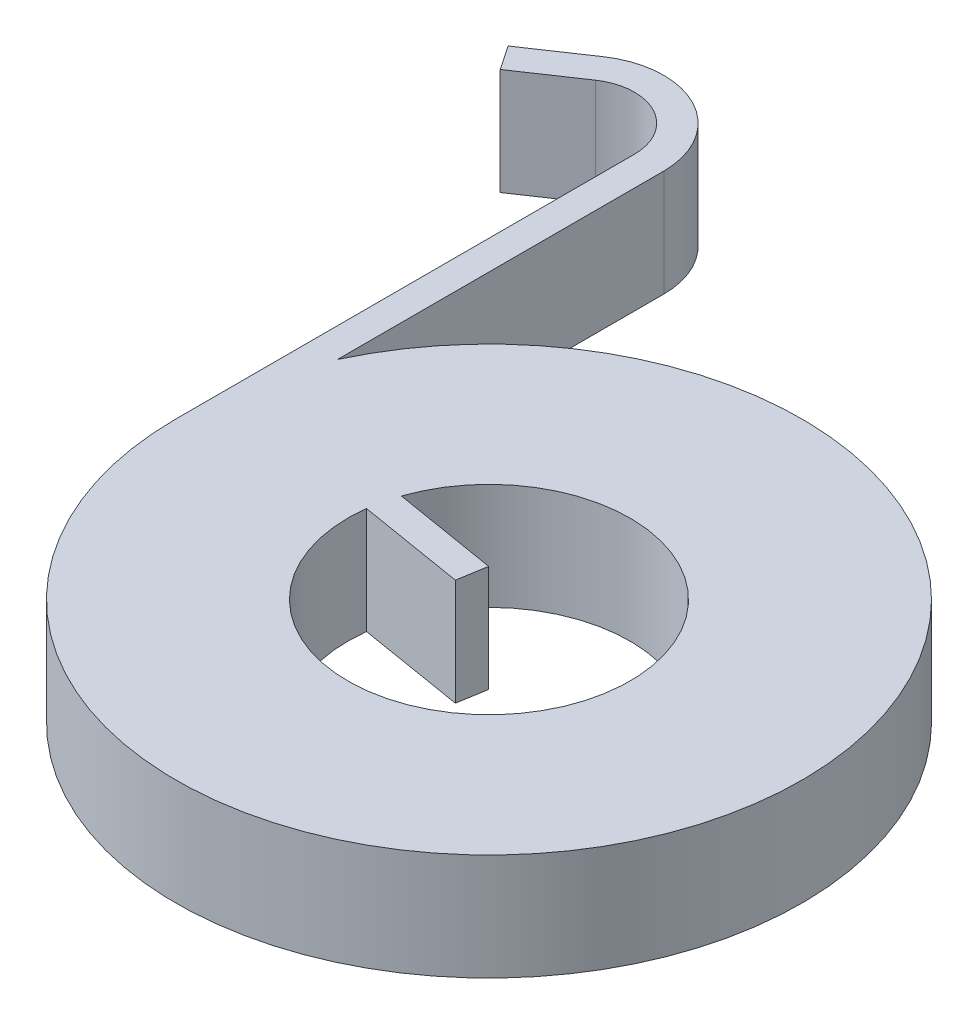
from build123d import *

# Parameters (mm, degrees)
BOSS_EXTRUDE1_DEPTH = 15.875


with BuildPart() as part:
    # Sketch1 → Boss-Extrude1 (new body)
    with BuildSketch(Plane(origin=(0, 0, 0), x_dir=(1, 0, 0), z_dir=(0, 1, 0))):
        with BuildLine():
            Line((-46.609, 0), (-46.609, 68.285149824))
            ThreePointArc((-46.609, 68.285149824), (-50.853758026, 75.349613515), (-59.084102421, 74.918279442))
            Line((-59.084102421, 74.918279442), (-67.539561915, 69.215))
            Line((-67.539561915, 69.215), (-69.977, 72.828650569))
            Line((-69.977, 72.828650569), (-61.521540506, 78.531930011))
            ThreePointArc((-61.521540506, 78.531930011), (-48.807401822, 79.198249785), (-42.250149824, 68.285149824))
            Line((-42.250149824, 68.285149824), (-42.250149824, 19.68054168))
            ThreePointArc((-42.250149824, 19.68054168), (45.506241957, -10.078731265), (-46.609, 0))
        make_face()
        with BuildLine():
            Line((-20.859071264, 2.617776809), (-5.0038, 0))
            Line((-5.0038, 0), (-4.300401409, 4.260323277))
            Line((-4.300401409, 4.260323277), (-19.881308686, 6.832801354))
            ThreePointArc((-19.881308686, 6.832801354), (20.478922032, -4.750511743), (-20.859071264, 2.617776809))
        make_face(mode=Mode.SUBTRACT)
    extrude(amount=BOSS_EXTRUDE1_DEPTH)


solid = part.part
